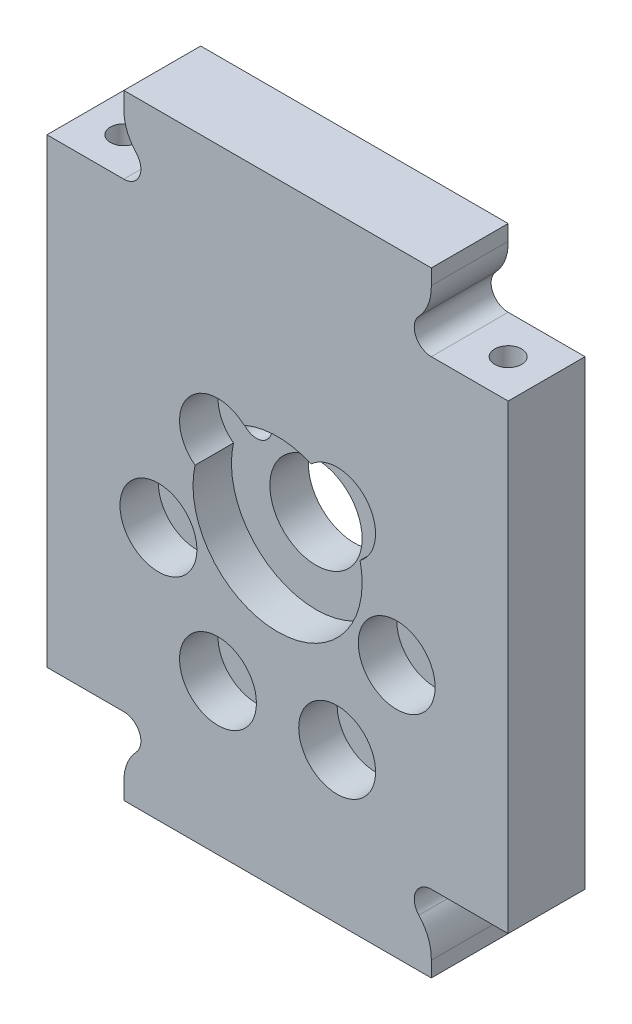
ISO-10303-21;
HEADER;
FILE_DESCRIPTION(('STEP AP214'),'2;1');
FILE_NAME('part.step','',(''),(''),'','','');
FILE_SCHEMA(('AUTOMOTIVE_DESIGN { 1 0 10303 214 1 1 1 1 }'));
ENDSEC;
DATA;
#1=APPLICATION_CONTEXT('core data for automotive mechanical design processes');
#2=APPLICATION_PROTOCOL_DEFINITION('international standard','automotive_design',2000,#1);
#3=PRODUCT_CONTEXT('',#1,'mechanical');
#4=PRODUCT('Part','Part','',(#3));
#5=PRODUCT_RELATED_PRODUCT_CATEGORY('part','',(#4));
#6=PRODUCT_DEFINITION_FORMATION('','',#4);
#7=PRODUCT_DEFINITION_CONTEXT('part definition',#1,'design');
#8=PRODUCT_DEFINITION('design','',#6,#7);
#9=PRODUCT_DEFINITION_SHAPE('','',#8);
#10=(LENGTH_UNIT() NAMED_UNIT(*) SI_UNIT(.MILLI.,.METRE.));
#11=(NAMED_UNIT(*) PLANE_ANGLE_UNIT() SI_UNIT($,.RADIAN.));
#12=(NAMED_UNIT(*) SI_UNIT($,.STERADIAN.) SOLID_ANGLE_UNIT());
#13=UNCERTAINTY_MEASURE_WITH_UNIT(LENGTH_MEASURE(1.E-05),#10,'distance_accuracy_value','');
#14=(GEOMETRIC_REPRESENTATION_CONTEXT(3) GLOBAL_UNCERTAINTY_ASSIGNED_CONTEXT((#13)) GLOBAL_UNIT_ASSIGNED_CONTEXT((#10,
#11,#12)) REPRESENTATION_CONTEXT('',''));
#15=CARTESIAN_POINT('',(0.,0.,0.));
#16=DIRECTION('',(0.,0.,1.));
#17=DIRECTION('',(1.,0.,0.));
#18=AXIS2_PLACEMENT_3D('',#15,#16,#17);
#19=CARTESIAN_POINT('',(0.,0.,0.));
#20=DIRECTION('',(0.,0.,1.));
#21=DIRECTION('',(1.,0.,0.));
#22=AXIS2_PLACEMENT_3D('',#19,#20,#21);
#23=CYLINDRICAL_SURFACE('',#22,6.);
#24=CARTESIAN_POINT('',(0.,0.,0.));
#25=DIRECTION('',(0.,0.,1.));
#26=DIRECTION('',(1.,0.,0.));
#27=AXIS2_PLACEMENT_3D('',#24,#25,#26);
#28=CIRCLE('',#27,6.);
#29=CARTESIAN_POINT('',(6.,0.,0.));
#30=VERTEX_POINT('',#29);
#31=EDGE_CURVE('E381',#30,#30,#28,.T.);
#32=ORIENTED_EDGE('',*,*,#31,.F.);
#33=EDGE_LOOP('',(#32));
#34=FACE_BOUND('',#33,.T.);
#35=CARTESIAN_POINT('',(0.,0.,5.));
#36=DIRECTION('',(0.,0.,1.));
#37=DIRECTION('',(1.,0.,0.));
#38=AXIS2_PLACEMENT_3D('',#35,#36,#37);
#39=CIRCLE('',#38,6.);
#40=CARTESIAN_POINT('',(6.,0.,5.));
#41=VERTEX_POINT('',#40);
#42=EDGE_CURVE('E244',#41,#41,#39,.F.);
#43=ORIENTED_EDGE('',*,*,#42,.F.);
#44=EDGE_LOOP('',(#43));
#45=FACE_BOUND('',#44,.T.);
#46=ADVANCED_FACE('F39',(#34,#45),#23,.F.);
#47=CARTESIAN_POINT('',(-15.5,-7.00000000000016,0.));
#48=DIRECTION('',(0.,0.,1.));
#49=DIRECTION('',(1.,0.,0.));
#50=AXIS2_PLACEMENT_3D('',#47,#48,#49);
#51=CYLINDRICAL_SURFACE('',#50,2.);
#52=CARTESIAN_POINT('',(-15.5,-7.00000000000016,0.));
#53=DIRECTION('',(0.,0.,1.));
#54=DIRECTION('',(0.50000000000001,-0.866025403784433,0.));
#55=AXIS2_PLACEMENT_3D('',#52,#53,#54);
#56=CIRCLE('',#55,2.);
#57=CARTESIAN_POINT('',(-14.5,-8.73205080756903,0.));
#58=VERTEX_POINT('',#57);
#59=EDGE_CURVE('E262',#58,#58,#56,.T.);
#60=ORIENTED_EDGE('',*,*,#59,.F.);
#61=EDGE_LOOP('',(#60));
#62=FACE_BOUND('',#61,.T.);
#63=CARTESIAN_POINT('',(-15.5,-7.00000000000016,5.));
#64=DIRECTION('',(0.,0.,1.));
#65=DIRECTION('',(1.,0.,0.));
#66=AXIS2_PLACEMENT_3D('',#63,#64,#65);
#67=CIRCLE('',#66,2.);
#68=CARTESIAN_POINT('',(-13.5,-7.00000000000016,5.));
#69=VERTEX_POINT('',#68);
#70=EDGE_CURVE('E43',#69,#69,#67,.F.);
#71=ORIENTED_EDGE('',*,*,#70,.F.);
#72=EDGE_LOOP('',(#71));
#73=FACE_BOUND('',#72,.T.);
#74=ADVANCED_FACE('F449',(#62,#73),#51,.F.);
#75=CARTESIAN_POINT('',(-7.75000000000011,6.42339375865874,0.));
#76=DIRECTION('',(0.,0.,1.));
#77=DIRECTION('',(1.,0.,0.));
#78=AXIS2_PLACEMENT_3D('',#75,#76,#77);
#79=CYLINDRICAL_SURFACE('',#78,2.);
#80=CARTESIAN_POINT('',(-7.75000000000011,6.42339375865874,0.));
#81=DIRECTION('',(0.,0.,1.));
#82=DIRECTION('',(-0.499999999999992,-0.866025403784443,0.));
#83=AXIS2_PLACEMENT_3D('',#80,#81,#82);
#84=CIRCLE('',#83,2.);
#85=CARTESIAN_POINT('',(-8.7500000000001,4.69134295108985,0.));
#86=VERTEX_POINT('',#85);
#87=EDGE_CURVE('E259',#86,#86,#84,.T.);
#88=ORIENTED_EDGE('',*,*,#87,.F.);
#89=EDGE_LOOP('',(#88));
#90=FACE_BOUND('',#89,.T.);
#91=CARTESIAN_POINT('',(-7.75000000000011,6.42339375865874,5.));
#92=DIRECTION('',(0.,0.,1.));
#93=DIRECTION('',(1.,0.,0.));
#94=AXIS2_PLACEMENT_3D('',#91,#92,#93);
#95=CIRCLE('',#94,2.);
#96=CARTESIAN_POINT('',(-5.75000000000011,6.42339375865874,5.));
#97=VERTEX_POINT('',#96);
#98=EDGE_CURVE('E247',#97,#97,#95,.F.);
#99=ORIENTED_EDGE('',*,*,#98,.F.);
#100=EDGE_LOOP('',(#99));
#101=FACE_BOUND('',#100,.T.);
#102=ADVANCED_FACE('F451',(#90,#101),#79,.F.);
#103=CARTESIAN_POINT('',(7.75000000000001,6.42339375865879,0.));
#104=DIRECTION('',(0.,0.,1.));
#105=DIRECTION('',(1.,0.,0.));
#106=AXIS2_PLACEMENT_3D('',#103,#104,#105);
#107=CYLINDRICAL_SURFACE('',#106,2.);
#108=CARTESIAN_POINT('',(7.75000000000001,6.42339375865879,0.));
#109=DIRECTION('',(0.,0.,1.));
#110=DIRECTION('',(-1.,0.,0.));
#111=AXIS2_PLACEMENT_3D('',#108,#109,#110);
#112=CIRCLE('',#111,2.);
#113=CARTESIAN_POINT('',(5.75000000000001,6.42339375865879,0.));
#114=VERTEX_POINT('',#113);
#115=EDGE_CURVE('E256',#114,#114,#112,.T.);
#116=ORIENTED_EDGE('',*,*,#115,.F.);
#117=EDGE_LOOP('',(#116));
#118=FACE_BOUND('',#117,.T.);
#119=CARTESIAN_POINT('',(7.75000000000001,6.42339375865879,5.));
#120=DIRECTION('',(0.,0.,1.));
#121=DIRECTION('',(1.,0.,0.));
#122=AXIS2_PLACEMENT_3D('',#119,#120,#121);
#123=CIRCLE('',#122,2.);
#124=CARTESIAN_POINT('',(9.75000000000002,6.42339375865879,5.));
#125=VERTEX_POINT('',#124);
#126=EDGE_CURVE('E248',#125,#125,#123,.F.);
#127=ORIENTED_EDGE('',*,*,#126,.F.);
#128=EDGE_LOOP('',(#127));
#129=FACE_BOUND('',#128,.T.);
#130=ADVANCED_FACE('F459',(#118,#129),#107,.F.);
#131=CARTESIAN_POINT('',(15.5,-6.99999999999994,0.));
#132=DIRECTION('',(0.,0.,1.));
#133=DIRECTION('',(1.,0.,0.));
#134=AXIS2_PLACEMENT_3D('',#131,#132,#133);
#135=CYLINDRICAL_SURFACE('',#134,2.);
#136=CARTESIAN_POINT('',(15.5,-6.99999999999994,0.));
#137=DIRECTION('',(0.,0.,1.));
#138=DIRECTION('',(-0.500000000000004,0.866025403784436,0.));
#139=AXIS2_PLACEMENT_3D('',#136,#137,#138);
#140=CIRCLE('',#139,2.);
#141=CARTESIAN_POINT('',(14.5,-5.26794919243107,0.));
#142=VERTEX_POINT('',#141);
#143=EDGE_CURVE('E253',#142,#142,#140,.T.);
#144=ORIENTED_EDGE('',*,*,#143,.F.);
#145=EDGE_LOOP('',(#144));
#146=FACE_BOUND('',#145,.T.);
#147=CARTESIAN_POINT('',(15.5,-6.99999999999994,5.));
#148=DIRECTION('',(0.,0.,1.));
#149=DIRECTION('',(1.,0.,0.));
#150=AXIS2_PLACEMENT_3D('',#147,#148,#149);
#151=CIRCLE('',#150,2.);
#152=CARTESIAN_POINT('',(17.5,-6.99999999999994,5.));
#153=VERTEX_POINT('',#152);
#154=EDGE_CURVE('E436',#153,#153,#151,.F.);
#155=ORIENTED_EDGE('',*,*,#154,.F.);
#156=EDGE_LOOP('',(#155));
#157=FACE_BOUND('',#156,.T.);
#158=ADVANCED_FACE('F832',(#146,#157),#135,.F.);
#159=CARTESIAN_POINT('',(7.75000000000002,-20.4233937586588,0.));
#160=DIRECTION('',(0.,0.,1.));
#161=DIRECTION('',(1.,0.,0.));
#162=AXIS2_PLACEMENT_3D('',#159,#160,#161);
#163=CYLINDRICAL_SURFACE('',#162,2.);
#164=CARTESIAN_POINT('',(7.75000000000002,-20.4233937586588,0.));
#165=DIRECTION('',(0.,0.,1.));
#166=DIRECTION('',(0.499999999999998,0.86602540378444,0.));
#167=AXIS2_PLACEMENT_3D('',#164,#165,#166);
#168=CIRCLE('',#167,2.);
#169=CARTESIAN_POINT('',(8.75000000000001,-18.6913429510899,0.));
#170=VERTEX_POINT('',#169);
#171=EDGE_CURVE('E249',#170,#170,#168,.T.);
#172=ORIENTED_EDGE('',*,*,#171,.F.);
#173=EDGE_LOOP('',(#172));
#174=FACE_BOUND('',#173,.T.);
#175=CARTESIAN_POINT('',(7.75000000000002,-20.4233937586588,5.));
#176=DIRECTION('',(0.,0.,1.));
#177=DIRECTION('',(1.,0.,0.));
#178=AXIS2_PLACEMENT_3D('',#175,#176,#177);
#179=CIRCLE('',#178,2.);
#180=CARTESIAN_POINT('',(9.75000000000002,-20.4233937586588,5.));
#181=VERTEX_POINT('',#180);
#182=EDGE_CURVE('E433',#181,#181,#179,.F.);
#183=ORIENTED_EDGE('',*,*,#182,.F.);
#184=EDGE_LOOP('',(#183));
#185=FACE_BOUND('',#184,.T.);
#186=ADVANCED_FACE('F481',(#174,#185),#163,.F.);
#187=CARTESIAN_POINT('',(-7.75000000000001,-20.4233937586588,0.));
#188=DIRECTION('',(0.,0.,1.));
#189=DIRECTION('',(1.,0.,0.));
#190=AXIS2_PLACEMENT_3D('',#187,#188,#189);
#191=CYLINDRICAL_SURFACE('',#190,2.);
#192=CARTESIAN_POINT('',(-7.75000000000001,-20.4233937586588,0.));
#193=DIRECTION('',(0.,0.,1.));
#194=DIRECTION('',(1.,0.,0.));
#195=AXIS2_PLACEMENT_3D('',#192,#193,#194);
#196=CIRCLE('',#195,2.);
#197=CARTESIAN_POINT('',(-5.75000000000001,-20.4233937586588,0.));
#198=VERTEX_POINT('',#197);
#199=EDGE_CURVE('E271',#198,#198,#196,.T.);
#200=ORIENTED_EDGE('',*,*,#199,.F.);
#201=EDGE_LOOP('',(#200));
#202=FACE_BOUND('',#201,.T.);
#203=CARTESIAN_POINT('',(-7.75000000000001,-20.4233937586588,5.));
#204=DIRECTION('',(0.,0.,1.));
#205=DIRECTION('',(1.,0.,0.));
#206=AXIS2_PLACEMENT_3D('',#203,#204,#205);
#207=CIRCLE('',#206,2.);
#208=CARTESIAN_POINT('',(-5.75000000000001,-20.4233937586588,5.));
#209=VERTEX_POINT('',#208);
#210=EDGE_CURVE('E268',#209,#209,#207,.F.);
#211=ORIENTED_EDGE('',*,*,#210,.F.);
#212=EDGE_LOOP('',(#211));
#213=FACE_BOUND('',#212,.T.);
#214=ADVANCED_FACE('F477',(#202,#213),#191,.F.);
#215=CARTESIAN_POINT('',(-29.9978281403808,-30.,10.));
#216=DIRECTION('',(0.,1.,0.));
#217=DIRECTION('',(-1.,0.,0.));
#218=AXIS2_PLACEMENT_3D('',#215,#216,#217);
#219=PLANE('',#218);
#220=CARTESIAN_POINT('',(25.,-30.,5.));
#221=DIRECTION('',(0.,1.,0.));
#222=DIRECTION('',(-1.,0.,0.));
#223=AXIS2_PLACEMENT_3D('',#220,#221,#222);
#224=CIRCLE('',#223,1.74999999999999);
#225=CARTESIAN_POINT('',(23.25,-30.,5.));
#226=VERTEX_POINT('',#225);
#227=EDGE_CURVE('E277',#226,#226,#224,.T.);
#228=ORIENTED_EDGE('',*,*,#227,.T.);
#229=EDGE_LOOP('',(#228));
#230=FACE_BOUND('',#229,.T.);
#231=DIRECTION('',(0.,0.,1.));
#232=VECTOR('',#231,1.);
#233=CARTESIAN_POINT('',(20.,-30.,0.));
#234=LINE('',#233,#232);
#235=CARTESIAN_POINT('',(20.,-30.,0.));
#236=VERTEX_POINT('',#235);
#237=CARTESIAN_POINT('',(20.,-30.,10.));
#238=VERTEX_POINT('',#237);
#239=EDGE_CURVE('E318',#236,#238,#234,.T.);
#240=ORIENTED_EDGE('',*,*,#239,.F.);
#241=DIRECTION('',(1.,0.,0.));
#242=VECTOR('',#241,1.);
#243=CARTESIAN_POINT('',(-29.9978281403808,-30.,0.));
#244=LINE('',#243,#242);
#245=CARTESIAN_POINT('',(29.9978281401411,-30.,0.));
#246=VERTEX_POINT('',#245);
#247=EDGE_CURVE('E420',#236,#246,#244,.T.);
#248=ORIENTED_EDGE('',*,*,#247,.T.);
#249=DIRECTION('',(0.,0.,-1.));
#250=VECTOR('',#249,1.);
#251=CARTESIAN_POINT('',(29.9978281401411,-30.,10.));
#252=LINE('',#251,#250);
#253=CARTESIAN_POINT('',(29.9978281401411,-30.,10.));
#254=VERTEX_POINT('',#253);
#255=EDGE_CURVE('E412',#254,#246,#252,.T.);
#256=ORIENTED_EDGE('',*,*,#255,.F.);
#257=DIRECTION('',(1.,0.,0.));
#258=VECTOR('',#257,1.);
#259=CARTESIAN_POINT('',(-29.9978281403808,-30.,10.));
#260=LINE('',#259,#258);
#261=EDGE_CURVE('E64',#238,#254,#260,.T.);
#262=ORIENTED_EDGE('',*,*,#261,.F.);
#263=EDGE_LOOP('',(#240,#248,#256,#262));
#264=FACE_BOUND('',#263,.T.);
#265=ADVANCED_FACE('F480',(#230,#264),#219,.F.);
#266=CARTESIAN_POINT('',(30.,30.,10.));
#267=DIRECTION('',(0.,-1.,0.));
#268=DIRECTION('',(1.,0.,0.));
#269=AXIS2_PLACEMENT_3D('',#266,#267,#268);
#270=PLANE('',#269);
#271=CARTESIAN_POINT('',(25.,30.,5.));
#272=DIRECTION('',(0.,1.,0.));
#273=DIRECTION('',(0.,0.,1.));
#274=AXIS2_PLACEMENT_3D('',#271,#272,#273);
#275=CIRCLE('',#274,1.74999999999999);
#276=CARTESIAN_POINT('',(25.,30.,6.74999999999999));
#277=VERTEX_POINT('',#276);
#278=EDGE_CURVE('E274',#277,#277,#275,.T.);
#279=ORIENTED_EDGE('',*,*,#278,.F.);
#280=EDGE_LOOP('',(#279));
#281=FACE_BOUND('',#280,.T.);
#282=DIRECTION('',(0.,0.,1.));
#283=VECTOR('',#282,1.);
#284=CARTESIAN_POINT('',(20.,30.,0.));
#285=LINE('',#284,#283);
#286=CARTESIAN_POINT('',(20.,30.,0.));
#287=VERTEX_POINT('',#286);
#288=CARTESIAN_POINT('',(20.,30.,10.));
#289=VERTEX_POINT('',#288);
#290=EDGE_CURVE('E392',#287,#289,#285,.T.);
#291=ORIENTED_EDGE('',*,*,#290,.T.);
#292=DIRECTION('',(-1.,0.,0.));
#293=VECTOR('',#292,1.);
#294=CARTESIAN_POINT('',(30.,30.,10.));
#295=LINE('',#294,#293);
#296=CARTESIAN_POINT('',(30.,30.,10.));
#297=VERTEX_POINT('',#296);
#298=EDGE_CURVE('E404',#297,#289,#295,.T.);
#299=ORIENTED_EDGE('',*,*,#298,.F.);
#300=DIRECTION('',(0.,0.,-1.));
#301=VECTOR('',#300,1.);
#302=CARTESIAN_POINT('',(30.,30.,10.));
#303=LINE('',#302,#301);
#304=CARTESIAN_POINT('',(30.,30.,0.));
#305=VERTEX_POINT('',#304);
#306=EDGE_CURVE('E11',#297,#305,#303,.T.);
#307=ORIENTED_EDGE('',*,*,#306,.T.);
#308=DIRECTION('',(-1.,0.,0.));
#309=VECTOR('',#308,1.);
#310=CARTESIAN_POINT('',(30.,30.,0.));
#311=LINE('',#310,#309);
#312=EDGE_CURVE('E416',#305,#287,#311,.T.);
#313=ORIENTED_EDGE('',*,*,#312,.T.);
#314=EDGE_LOOP('',(#291,#299,#307,#313));
#315=FACE_BOUND('',#314,.T.);
#316=ADVANCED_FACE('F564',(#281,#315),#270,.F.);
#317=CARTESIAN_POINT('',(30.,30.,10.));
#318=DIRECTION('',(-0.999999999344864,3.61976642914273E-05,0.));
#319=DIRECTION('',(-3.61976642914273E-05,-0.999999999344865,0.));
#320=AXIS2_PLACEMENT_3D('',#317,#318,#319);
#321=PLANE('',#320);
#322=DIRECTION('',(3.61976642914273E-05,0.999999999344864,0.));
#323=VECTOR('',#322,1.);
#324=CARTESIAN_POINT('',(30.,30.,0.));
#325=LINE('',#324,#323);
#326=EDGE_CURVE('E398',#246,#305,#325,.T.);
#327=ORIENTED_EDGE('',*,*,#326,.T.);
#328=ORIENTED_EDGE('',*,*,#306,.F.);
#329=DIRECTION('',(3.61976642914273E-05,0.999999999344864,0.));
#330=VECTOR('',#329,1.);
#331=CARTESIAN_POINT('',(30.,30.,10.));
#332=LINE('',#331,#330);
#333=EDGE_CURVE('E399',#254,#297,#332,.T.);
#334=ORIENTED_EDGE('',*,*,#333,.F.);
#335=ORIENTED_EDGE('',*,*,#255,.T.);
#336=EDGE_LOOP('',(#327,#328,#334,#335));
#337=FACE_BOUND('',#336,.T.);
#338=ADVANCED_FACE('F41',(#337),#321,.F.);
#339=CARTESIAN_POINT('',(-25.,30.,5.));
#340=DIRECTION('',(0.,1.,0.));
#341=DIRECTION('',(0.,0.,1.));
#342=AXIS2_PLACEMENT_3D('',#339,#340,#341);
#343=CIRCLE('',#342,1.74999999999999);
#344=CARTESIAN_POINT('',(-25.,30.,6.74999999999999));
#345=VERTEX_POINT('',#344);
#346=EDGE_CURVE('E280',#345,#345,#343,.T.);
#347=ORIENTED_EDGE('',*,*,#346,.F.);
#348=EDGE_LOOP('',(#347));
#349=FACE_BOUND('',#348,.T.);
#350=CARTESIAN_POINT('',(-20.,30.,10.));
#351=VERTEX_POINT('',#350);
#352=CARTESIAN_POINT('',(-30.,30.,10.));
#353=VERTEX_POINT('',#352);
#354=EDGE_CURVE('E402',#351,#353,#295,.T.);
#355=ORIENTED_EDGE('',*,*,#354,.F.);
#356=DIRECTION('',(0.,0.,1.));
#357=VECTOR('',#356,1.);
#358=CARTESIAN_POINT('',(-20.,30.,0.));
#359=LINE('',#358,#357);
#360=CARTESIAN_POINT('',(-20.,30.,0.));
#361=VERTEX_POINT('',#360);
#362=EDGE_CURVE('E359',#361,#351,#359,.T.);
#363=ORIENTED_EDGE('',*,*,#362,.F.);
#364=CARTESIAN_POINT('',(-30.,30.,0.));
#365=VERTEX_POINT('',#364);
#366=EDGE_CURVE('E415',#361,#365,#311,.T.);
#367=ORIENTED_EDGE('',*,*,#366,.T.);
#368=DIRECTION('',(0.,0.,-1.));
#369=VECTOR('',#368,1.);
#370=CARTESIAN_POINT('',(-30.,30.,10.));
#371=LINE('',#370,#369);
#372=EDGE_CURVE('E48',#353,#365,#371,.T.);
#373=ORIENTED_EDGE('',*,*,#372,.F.);
#374=EDGE_LOOP('',(#355,#363,#367,#373));
#375=FACE_BOUND('',#374,.T.);
#376=ADVANCED_FACE('F560',(#349,#375),#270,.F.);
#377=CARTESIAN_POINT('',(-30.,30.,10.));
#378=DIRECTION('',(0.999999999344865,3.61976602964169E-05,0.));
#379=DIRECTION('',(-3.61976602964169E-05,0.999999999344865,0.));
#380=AXIS2_PLACEMENT_3D('',#377,#378,#379);
#381=PLANE('',#380);
#382=DIRECTION('',(3.61976602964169E-05,-0.999999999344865,0.));
#383=VECTOR('',#382,1.);
#384=CARTESIAN_POINT('',(-30.,30.,0.));
#385=LINE('',#384,#383);
#386=CARTESIAN_POINT('',(-29.9978281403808,-30.,0.));
#387=VERTEX_POINT('',#386);
#388=EDGE_CURVE('E418',#365,#387,#385,.T.);
#389=ORIENTED_EDGE('',*,*,#388,.T.);
#390=DIRECTION('',(0.,0.,-1.));
#391=VECTOR('',#390,1.);
#392=CARTESIAN_POINT('',(-29.9978281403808,-30.,10.));
#393=LINE('',#392,#391);
#394=CARTESIAN_POINT('',(-29.9978281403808,-30.,10.));
#395=VERTEX_POINT('',#394);
#396=EDGE_CURVE('E424',#395,#387,#393,.T.);
#397=ORIENTED_EDGE('',*,*,#396,.F.);
#398=DIRECTION('',(3.61976602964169E-05,-0.999999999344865,0.));
#399=VECTOR('',#398,1.);
#400=CARTESIAN_POINT('',(-30.,30.,10.));
#401=LINE('',#400,#399);
#402=EDGE_CURVE('E407',#353,#395,#401,.T.);
#403=ORIENTED_EDGE('',*,*,#402,.F.);
#404=ORIENTED_EDGE('',*,*,#372,.T.);
#405=EDGE_LOOP('',(#389,#397,#403,#404));
#406=FACE_BOUND('',#405,.T.);
#407=ADVANCED_FACE('F557',(#406),#381,.F.);
#408=CARTESIAN_POINT('',(-25.,-30.,5.));
#409=DIRECTION('',(0.,1.,0.));
#410=DIRECTION('',(-1.,0.,0.));
#411=AXIS2_PLACEMENT_3D('',#408,#409,#410);
#412=CIRCLE('',#411,1.74999999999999);
#413=CARTESIAN_POINT('',(-26.75,-30.,5.));
#414=VERTEX_POINT('',#413);
#415=EDGE_CURVE('E283',#414,#414,#412,.T.);
#416=ORIENTED_EDGE('',*,*,#415,.T.);
#417=EDGE_LOOP('',(#416));
#418=FACE_BOUND('',#417,.T.);
#419=CARTESIAN_POINT('',(-20.,-30.,0.));
#420=VERTEX_POINT('',#419);
#421=EDGE_CURVE('E403',#387,#420,#244,.T.);
#422=ORIENTED_EDGE('',*,*,#421,.T.);
#423=DIRECTION('',(0.,0.,1.));
#424=VECTOR('',#423,1.);
#425=CARTESIAN_POINT('',(-20.,-30.,0.));
#426=LINE('',#425,#424);
#427=CARTESIAN_POINT('',(-20.,-30.,10.));
#428=VERTEX_POINT('',#427);
#429=EDGE_CURVE('E315',#420,#428,#426,.T.);
#430=ORIENTED_EDGE('',*,*,#429,.T.);
#431=EDGE_CURVE('E409',#395,#428,#260,.T.);
#432=ORIENTED_EDGE('',*,*,#431,.F.);
#433=ORIENTED_EDGE('',*,*,#396,.T.);
#434=EDGE_LOOP('',(#422,#430,#432,#433));
#435=FACE_BOUND('',#434,.T.);
#436=ADVANCED_FACE('F550',(#418,#435),#219,.F.);
#437=CARTESIAN_POINT('',(0.,0.,10.));
#438=DIRECTION('',(0.,0.,1.));
#439=DIRECTION('',(1.,0.,0.));
#440=AXIS2_PLACEMENT_3D('',#437,#438,#439);
#441=PLANE('',#440);
#442=CARTESIAN_POINT('',(0.,0.,10.));
#443=DIRECTION('',(0.,0.,1.));
#444=DIRECTION('',(1.,0.,0.));
#445=AXIS2_PLACEMENT_3D('',#442,#443,#444);
#446=CIRCLE('',#445,11.);
#447=CARTESIAN_POINT('',(4.36024104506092,10.0989255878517,10.));
#448=VERTEX_POINT('',#447);
#449=CARTESIAN_POINT('',(-4.36024104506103,10.0989255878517,10.));
#450=VERTEX_POINT('',#449);
#451=EDGE_CURVE('E222',#448,#450,#446,.T.);
#452=ORIENTED_EDGE('',*,*,#451,.F.);
#453=CARTESIAN_POINT('',(7.75000000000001,6.42339375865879,10.));
#454=DIRECTION('',(0.,0.,1.));
#455=DIRECTION('',(-1.,0.,0.));
#456=AXIS2_PLACEMENT_3D('',#453,#454,#455);
#457=CIRCLE('',#456,5.);
#458=CARTESIAN_POINT('',(10.7326501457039,2.41043997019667,10.));
#459=VERTEX_POINT('',#458);
#460=EDGE_CURVE('E227',#459,#448,#457,.T.);
#461=ORIENTED_EDGE('',*,*,#460,.F.);
#462=CARTESIAN_POINT('',(-10.7326501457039,2.41043997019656,10.));
#463=VERTEX_POINT('',#462);
#464=EDGE_CURVE('E209',#463,#459,#446,.T.);
#465=ORIENTED_EDGE('',*,*,#464,.F.);
#466=CARTESIAN_POINT('',(-7.75000000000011,6.42339375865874,10.));
#467=DIRECTION('',(0.,0.,1.));
#468=DIRECTION('',(-0.499999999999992,-0.866025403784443,0.));
#469=AXIS2_PLACEMENT_3D('',#466,#467,#468);
#470=CIRCLE('',#469,5.);
#471=EDGE_CURVE('E236',#450,#463,#470,.T.);
#472=ORIENTED_EDGE('',*,*,#471,.F.);
#473=EDGE_LOOP('',(#452,#461,#465,#472));
#474=FACE_BOUND('',#473,.T.);
#475=CARTESIAN_POINT('',(7.75000000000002,-20.4233937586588,10.));
#476=DIRECTION('',(0.,0.,1.));
#477=DIRECTION('',(0.499999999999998,0.86602540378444,0.));
#478=AXIS2_PLACEMENT_3D('',#475,#476,#477);
#479=CIRCLE('',#478,5.);
#480=CARTESIAN_POINT('',(10.25,-16.0932667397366,10.));
#481=VERTEX_POINT('',#480);
#482=EDGE_CURVE('E987',#481,#481,#479,.T.);
#483=ORIENTED_EDGE('',*,*,#482,.F.);
#484=EDGE_LOOP('',(#483));
#485=FACE_BOUND('',#484,.T.);
#486=CARTESIAN_POINT('',(15.5,-6.99999999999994,10.));
#487=DIRECTION('',(0.,0.,1.));
#488=DIRECTION('',(-0.500000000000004,0.866025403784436,0.));
#489=AXIS2_PLACEMENT_3D('',#486,#487,#488);
#490=CIRCLE('',#489,5.);
#491=CARTESIAN_POINT('',(13.,-2.66987298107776,10.));
#492=VERTEX_POINT('',#491);
#493=EDGE_CURVE('E226',#492,#492,#490,.T.);
#494=ORIENTED_EDGE('',*,*,#493,.F.);
#495=EDGE_LOOP('',(#494));
#496=FACE_BOUND('',#495,.T.);
#497=CARTESIAN_POINT('',(-15.5,-7.00000000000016,10.));
#498=DIRECTION('',(0.,0.,1.));
#499=DIRECTION('',(0.50000000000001,-0.866025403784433,0.));
#500=AXIS2_PLACEMENT_3D('',#497,#498,#499);
#501=CIRCLE('',#500,5.);
#502=CARTESIAN_POINT('',(-12.9999999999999,-11.3301270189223,10.));
#503=VERTEX_POINT('',#502);
#504=EDGE_CURVE('E214',#503,#503,#501,.T.);
#505=ORIENTED_EDGE('',*,*,#504,.F.);
#506=EDGE_LOOP('',(#505));
#507=FACE_BOUND('',#506,.T.);
#508=CARTESIAN_POINT('',(-7.75000000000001,-20.4233937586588,10.));
#509=DIRECTION('',(0.,0.,1.));
#510=DIRECTION('',(1.,0.,0.));
#511=AXIS2_PLACEMENT_3D('',#508,#509,#510);
#512=CIRCLE('',#511,5.);
#513=CARTESIAN_POINT('',(-2.75000000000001,-20.4233937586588,10.));
#514=VERTEX_POINT('',#513);
#515=EDGE_CURVE('E252',#514,#514,#512,.T.);
#516=ORIENTED_EDGE('',*,*,#515,.F.);
#517=EDGE_LOOP('',(#516));
#518=FACE_BOUND('',#517,.T.);
#519=ORIENTED_EDGE('',*,*,#333,.T.);
#520=ORIENTED_EDGE('',*,*,#298,.T.);
#521=CARTESIAN_POINT('',(20.,32.2199999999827,10.));
#522=DIRECTION('',(0.,0.,-1.));
#523=DIRECTION('',(-1.,0.,0.));
#524=AXIS2_PLACEMENT_3D('',#521,#522,#523);
#525=CIRCLE('',#524,2.21999999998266);
#526=CARTESIAN_POINT('',(18.3801323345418,33.7380345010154,10.));
#527=VERTEX_POINT('',#526);
#528=EDGE_CURVE('E362',#289,#527,#525,.T.);
#529=ORIENTED_EDGE('',*,*,#528,.T.);
#530=CARTESIAN_POINT('',(14.0021116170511,37.8408304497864,10.));
#531=DIRECTION('',(0.,0.,1.));
#532=DIRECTION('',(-1.,0.,0.));
#533=AXIS2_PLACEMENT_3D('',#530,#531,#532);
#534=CIRCLE('',#533,6.00000000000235);
#535=CARTESIAN_POINT('',(20.,38.0000000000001,10.));
#536=VERTEX_POINT('',#535);
#537=EDGE_CURVE('E365',#527,#536,#534,.T.);
#538=ORIENTED_EDGE('',*,*,#537,.T.);
#539=DIRECTION('',(0.,1.,0.));
#540=VECTOR('',#539,1.);
#541=CARTESIAN_POINT('',(20.,38.0000000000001,10.));
#542=LINE('',#541,#540);
#543=CARTESIAN_POINT('',(20.,40.,10.));
#544=VERTEX_POINT('',#543);
#545=EDGE_CURVE('E368',#536,#544,#542,.T.);
#546=ORIENTED_EDGE('',*,*,#545,.T.);
#547=DIRECTION('',(-1.,0.,0.));
#548=VECTOR('',#547,1.);
#549=CARTESIAN_POINT('',(-20.,40.,10.));
#550=LINE('',#549,#548);
#551=CARTESIAN_POINT('',(-20.,40.,10.));
#552=VERTEX_POINT('',#551);
#553=EDGE_CURVE('E371',#544,#552,#550,.T.);
#554=ORIENTED_EDGE('',*,*,#553,.T.);
#555=DIRECTION('',(0.,-1.,0.));
#556=VECTOR('',#555,1.);
#557=CARTESIAN_POINT('',(-20.,38.0000000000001,10.));
#558=LINE('',#557,#556);
#559=CARTESIAN_POINT('',(-20.,38.0000000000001,10.));
#560=VERTEX_POINT('',#559);
#561=EDGE_CURVE('E374',#552,#560,#558,.T.);
#562=ORIENTED_EDGE('',*,*,#561,.T.);
#563=CARTESIAN_POINT('',(-14.0021116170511,37.8408304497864,10.));
#564=DIRECTION('',(0.,0.,1.));
#565=DIRECTION('',(1.,0.,0.));
#566=AXIS2_PLACEMENT_3D('',#563,#564,#565);
#567=CIRCLE('',#566,6.00000000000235);
#568=CARTESIAN_POINT('',(-18.3801323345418,33.7380345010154,10.));
#569=VERTEX_POINT('',#568);
#570=EDGE_CURVE('E341',#560,#569,#567,.T.);
#571=ORIENTED_EDGE('',*,*,#570,.T.);
#572=CARTESIAN_POINT('',(-20.,32.2199999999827,10.));
#573=DIRECTION('',(0.,0.,-1.));
#574=DIRECTION('',(1.,0.,0.));
#575=AXIS2_PLACEMENT_3D('',#572,#573,#574);
#576=CIRCLE('',#575,2.21999999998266);
#577=EDGE_CURVE('E317',#569,#351,#576,.T.);
#578=ORIENTED_EDGE('',*,*,#577,.T.);
#579=ORIENTED_EDGE('',*,*,#354,.T.);
#580=ORIENTED_EDGE('',*,*,#402,.T.);
#581=ORIENTED_EDGE('',*,*,#431,.T.);
#582=CARTESIAN_POINT('',(-20.,-32.2199999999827,10.));
#583=DIRECTION('',(0.,0.,1.));
#584=DIRECTION('',(1.,0.,0.));
#585=AXIS2_PLACEMENT_3D('',#582,#583,#584);
#586=CIRCLE('',#585,2.21999999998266);
#587=CARTESIAN_POINT('',(-18.3801323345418,-33.7380345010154,10.));
#588=VERTEX_POINT('',#587);
#589=EDGE_CURVE('E301',#588,#428,#586,.T.);
#590=ORIENTED_EDGE('',*,*,#589,.F.);
#591=CARTESIAN_POINT('',(-14.0021116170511,-37.8408304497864,10.));
#592=DIRECTION('',(0.,0.,-1.));
#593=DIRECTION('',(1.,0.,0.));
#594=AXIS2_PLACEMENT_3D('',#591,#592,#593);
#595=CIRCLE('',#594,6.00000000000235);
#596=CARTESIAN_POINT('',(-20.,-38.0000000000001,10.));
#597=VERTEX_POINT('',#596);
#598=EDGE_CURVE('E304',#597,#588,#595,.T.);
#599=ORIENTED_EDGE('',*,*,#598,.F.);
#600=DIRECTION('',(0.,1.,0.));
#601=VECTOR('',#600,1.);
#602=CARTESIAN_POINT('',(-20.,-38.0000000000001,10.));
#603=LINE('',#602,#601);
#604=CARTESIAN_POINT('',(-20.,-40.,10.));
#605=VERTEX_POINT('',#604);
#606=EDGE_CURVE('E306',#605,#597,#603,.T.);
#607=ORIENTED_EDGE('',*,*,#606,.F.);
#608=DIRECTION('',(-1.,0.,0.));
#609=VECTOR('',#608,1.);
#610=CARTESIAN_POINT('',(-20.,-40.,10.));
#611=LINE('',#610,#609);
#612=CARTESIAN_POINT('',(20.,-40.,10.));
#613=VERTEX_POINT('',#612);
#614=EDGE_CURVE('E308',#613,#605,#611,.T.);
#615=ORIENTED_EDGE('',*,*,#614,.F.);
#616=DIRECTION('',(0.,-1.,0.));
#617=VECTOR('',#616,1.);
#618=CARTESIAN_POINT('',(20.,-38.0000000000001,10.));
#619=LINE('',#618,#617);
#620=CARTESIAN_POINT('',(20.,-38.0000000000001,10.));
#621=VERTEX_POINT('',#620);
#622=EDGE_CURVE('E310',#621,#613,#619,.T.);
#623=ORIENTED_EDGE('',*,*,#622,.F.);
#624=CARTESIAN_POINT('',(14.0021116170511,-37.8408304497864,10.));
#625=DIRECTION('',(0.,0.,-1.));
#626=DIRECTION('',(-1.,0.,0.));
#627=AXIS2_PLACEMENT_3D('',#624,#625,#626);
#628=CIRCLE('',#627,6.00000000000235);
#629=CARTESIAN_POINT('',(18.3801323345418,-33.7380345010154,10.));
#630=VERTEX_POINT('',#629);
#631=EDGE_CURVE('E312',#630,#621,#628,.T.);
#632=ORIENTED_EDGE('',*,*,#631,.F.);
#633=CARTESIAN_POINT('',(20.,-32.2199999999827,10.));
#634=DIRECTION('',(0.,0.,1.));
#635=DIRECTION('',(-1.,0.,0.));
#636=AXIS2_PLACEMENT_3D('',#633,#634,#635);
#637=CIRCLE('',#636,2.21999999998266);
#638=EDGE_CURVE('E288',#238,#630,#637,.T.);
#639=ORIENTED_EDGE('',*,*,#638,.F.);
#640=ORIENTED_EDGE('',*,*,#261,.T.);
#641=EDGE_LOOP('',(#519,#520,#529,#538,#546,#554,#562,#571,#578,#579,#580,#581,#590,#599,#607,
#615,#623,#632,#639,#640));
#642=FACE_BOUND('',#641,.T.);
#643=ADVANCED_FACE('F547',(#474,#485,#496,#507,#518,#642),#441,.T.);
#644=CARTESIAN_POINT('',(0.,0.,0.));
#645=DIRECTION('',(0.,0.,1.));
#646=DIRECTION('',(1.,0.,0.));
#647=AXIS2_PLACEMENT_3D('',#644,#645,#646);
#648=PLANE('',#647);
#649=ORIENTED_EDGE('',*,*,#171,.T.);
#650=EDGE_LOOP('',(#649));
#651=FACE_BOUND('',#650,.T.);
#652=ORIENTED_EDGE('',*,*,#143,.T.);
#653=EDGE_LOOP('',(#652));
#654=FACE_BOUND('',#653,.T.);
#655=ORIENTED_EDGE('',*,*,#115,.T.);
#656=EDGE_LOOP('',(#655));
#657=FACE_BOUND('',#656,.T.);
#658=ORIENTED_EDGE('',*,*,#87,.T.);
#659=EDGE_LOOP('',(#658));
#660=FACE_BOUND('',#659,.T.);
#661=ORIENTED_EDGE('',*,*,#59,.T.);
#662=EDGE_LOOP('',(#661));
#663=FACE_BOUND('',#662,.T.);
#664=ORIENTED_EDGE('',*,*,#199,.T.);
#665=EDGE_LOOP('',(#664));
#666=FACE_BOUND('',#665,.T.);
#667=ORIENTED_EDGE('',*,*,#31,.T.);
#668=EDGE_LOOP('',(#667));
#669=FACE_BOUND('',#668,.T.);
#670=ORIENTED_EDGE('',*,*,#326,.F.);
#671=ORIENTED_EDGE('',*,*,#247,.F.);
#672=CARTESIAN_POINT('',(20.,-32.2199999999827,0.));
#673=DIRECTION('',(0.,0.,1.));
#674=DIRECTION('',(-1.,0.,0.));
#675=AXIS2_PLACEMENT_3D('',#672,#673,#674);
#676=CIRCLE('',#675,2.21999999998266);
#677=CARTESIAN_POINT('',(18.3801323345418,-33.7380345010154,0.));
#678=VERTEX_POINT('',#677);
#679=EDGE_CURVE('E298',#236,#678,#676,.T.);
#680=ORIENTED_EDGE('',*,*,#679,.T.);
#681=CARTESIAN_POINT('',(14.0021116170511,-37.8408304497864,0.));
#682=DIRECTION('',(0.,0.,-1.));
#683=DIRECTION('',(-1.,0.,0.));
#684=AXIS2_PLACEMENT_3D('',#681,#682,#683);
#685=CIRCLE('',#684,6.00000000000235);
#686=CARTESIAN_POINT('',(20.,-38.0000000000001,0.));
#687=VERTEX_POINT('',#686);
#688=EDGE_CURVE('E296',#678,#687,#685,.T.);
#689=ORIENTED_EDGE('',*,*,#688,.T.);
#690=DIRECTION('',(0.,-1.,0.));
#691=VECTOR('',#690,1.);
#692=CARTESIAN_POINT('',(20.,-38.0000000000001,0.));
#693=LINE('',#692,#691);
#694=CARTESIAN_POINT('',(20.,-40.,0.));
#695=VERTEX_POINT('',#694);
#696=EDGE_CURVE('E294',#687,#695,#693,.T.);
#697=ORIENTED_EDGE('',*,*,#696,.T.);
#698=DIRECTION('',(-1.,0.,0.));
#699=VECTOR('',#698,1.);
#700=CARTESIAN_POINT('',(-20.,-40.,0.));
#701=LINE('',#700,#699);
#702=CARTESIAN_POINT('',(-20.,-40.,0.));
#703=VERTEX_POINT('',#702);
#704=EDGE_CURVE('E292',#695,#703,#701,.T.);
#705=ORIENTED_EDGE('',*,*,#704,.T.);
#706=DIRECTION('',(0.,1.,0.));
#707=VECTOR('',#706,1.);
#708=CARTESIAN_POINT('',(-20.,-38.0000000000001,0.));
#709=LINE('',#708,#707);
#710=CARTESIAN_POINT('',(-20.,-38.0000000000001,0.));
#711=VERTEX_POINT('',#710);
#712=EDGE_CURVE('E290',#703,#711,#709,.T.);
#713=ORIENTED_EDGE('',*,*,#712,.T.);
#714=CARTESIAN_POINT('',(-14.0021116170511,-37.8408304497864,0.));
#715=DIRECTION('',(0.,0.,-1.));
#716=DIRECTION('',(1.,0.,0.));
#717=AXIS2_PLACEMENT_3D('',#714,#715,#716);
#718=CIRCLE('',#717,6.00000000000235);
#719=CARTESIAN_POINT('',(-18.3801323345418,-33.7380345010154,0.));
#720=VERTEX_POINT('',#719);
#721=EDGE_CURVE('E287',#711,#720,#718,.T.);
#722=ORIENTED_EDGE('',*,*,#721,.T.);
#723=CARTESIAN_POINT('',(-20.,-32.2199999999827,0.));
#724=DIRECTION('',(0.,0.,1.));
#725=DIRECTION('',(1.,0.,0.));
#726=AXIS2_PLACEMENT_3D('',#723,#724,#725);
#727=CIRCLE('',#726,2.21999999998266);
#728=EDGE_CURVE('E284',#720,#420,#727,.T.);
#729=ORIENTED_EDGE('',*,*,#728,.T.);
#730=ORIENTED_EDGE('',*,*,#421,.F.);
#731=ORIENTED_EDGE('',*,*,#388,.F.);
#732=ORIENTED_EDGE('',*,*,#366,.F.);
#733=CARTESIAN_POINT('',(-20.,32.2199999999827,0.));
#734=DIRECTION('',(0.,0.,-1.));
#735=DIRECTION('',(1.,0.,0.));
#736=AXIS2_PLACEMENT_3D('',#733,#734,#735);
#737=CIRCLE('',#736,2.21999999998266);
#738=CARTESIAN_POINT('',(-18.3801323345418,33.7380345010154,0.));
#739=VERTEX_POINT('',#738);
#740=EDGE_CURVE('E337',#739,#361,#737,.T.);
#741=ORIENTED_EDGE('',*,*,#740,.F.);
#742=CARTESIAN_POINT('',(-14.0021116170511,37.8408304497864,0.));
#743=DIRECTION('',(0.,0.,1.));
#744=DIRECTION('',(1.,0.,0.));
#745=AXIS2_PLACEMENT_3D('',#742,#743,#744);
#746=CIRCLE('',#745,6.00000000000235);
#747=CARTESIAN_POINT('',(-20.,38.0000000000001,0.));
#748=VERTEX_POINT('',#747);
#749=EDGE_CURVE('E356',#748,#739,#746,.T.);
#750=ORIENTED_EDGE('',*,*,#749,.F.);
#751=DIRECTION('',(0.,-1.,0.));
#752=VECTOR('',#751,1.);
#753=CARTESIAN_POINT('',(-20.,38.0000000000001,0.));
#754=LINE('',#753,#752);
#755=CARTESIAN_POINT('',(-20.,40.,0.));
#756=VERTEX_POINT('',#755);
#757=EDGE_CURVE('E353',#756,#748,#754,.T.);
#758=ORIENTED_EDGE('',*,*,#757,.F.);
#759=DIRECTION('',(-1.,0.,0.));
#760=VECTOR('',#759,1.);
#761=CARTESIAN_POINT('',(-20.,40.,0.));
#762=LINE('',#761,#760);
#763=CARTESIAN_POINT('',(20.,40.,0.));
#764=VERTEX_POINT('',#763);
#765=EDGE_CURVE('E350',#764,#756,#762,.T.);
#766=ORIENTED_EDGE('',*,*,#765,.F.);
#767=DIRECTION('',(0.,1.,0.));
#768=VECTOR('',#767,1.);
#769=CARTESIAN_POINT('',(20.,38.0000000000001,0.));
#770=LINE('',#769,#768);
#771=CARTESIAN_POINT('',(20.,38.0000000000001,0.));
#772=VERTEX_POINT('',#771);
#773=EDGE_CURVE('E347',#772,#764,#770,.T.);
#774=ORIENTED_EDGE('',*,*,#773,.F.);
#775=CARTESIAN_POINT('',(14.0021116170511,37.8408304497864,0.));
#776=DIRECTION('',(0.,0.,1.));
#777=DIRECTION('',(-1.,0.,0.));
#778=AXIS2_PLACEMENT_3D('',#775,#776,#777);
#779=CIRCLE('',#778,6.00000000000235);
#780=CARTESIAN_POINT('',(18.3801323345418,33.7380345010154,0.));
#781=VERTEX_POINT('',#780);
#782=EDGE_CURVE('E344',#781,#772,#779,.T.);
#783=ORIENTED_EDGE('',*,*,#782,.F.);
#784=CARTESIAN_POINT('',(20.,32.2199999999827,0.));
#785=DIRECTION('',(0.,0.,-1.));
#786=DIRECTION('',(-1.,0.,0.));
#787=AXIS2_PLACEMENT_3D('',#784,#785,#786);
#788=CIRCLE('',#787,2.21999999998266);
#789=EDGE_CURVE('E340',#287,#781,#788,.T.);
#790=ORIENTED_EDGE('',*,*,#789,.F.);
#791=ORIENTED_EDGE('',*,*,#312,.F.);
#792=EDGE_LOOP('',(#670,#671,#680,#689,#697,#705,#713,#722,#729,#730,#731,#732,#741,#750,#758,
#766,#774,#783,#790,#791));
#793=FACE_BOUND('',#792,.T.);
#794=ADVANCED_FACE('F544',(#651,#654,#657,#660,#663,#666,#669,#793),#648,.F.);
#795=CARTESIAN_POINT('',(-20.,32.2199999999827,0.));
#796=DIRECTION('',(0.,0.,1.));
#797=DIRECTION('',(1.,0.,0.));
#798=AXIS2_PLACEMENT_3D('',#795,#796,#797);
#799=CYLINDRICAL_SURFACE('',#798,2.21999999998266);
#800=ORIENTED_EDGE('',*,*,#577,.F.);
#801=DIRECTION('',(0.,0.,1.));
#802=VECTOR('',#801,1.);
#803=CARTESIAN_POINT('',(-18.3801323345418,33.7380345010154,0.));
#804=LINE('',#803,#802);
#805=EDGE_CURVE('E379',#739,#569,#804,.T.);
#806=ORIENTED_EDGE('',*,*,#805,.F.);
#807=ORIENTED_EDGE('',*,*,#740,.T.);
#808=ORIENTED_EDGE('',*,*,#362,.T.);
#809=EDGE_LOOP('',(#800,#806,#807,#808));
#810=FACE_BOUND('',#809,.T.);
#811=ADVANCED_FACE('F523',(#810),#799,.F.);
#812=CARTESIAN_POINT('',(-14.0021116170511,37.8408304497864,0.));
#813=DIRECTION('',(0.,0.,1.));
#814=DIRECTION('',(1.,0.,0.));
#815=AXIS2_PLACEMENT_3D('',#812,#813,#814);
#816=CYLINDRICAL_SURFACE('',#815,6.00000000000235);
#817=ORIENTED_EDGE('',*,*,#570,.F.);
#818=DIRECTION('',(0.,0.,1.));
#819=VECTOR('',#818,1.);
#820=CARTESIAN_POINT('',(-20.,38.0000000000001,0.));
#821=LINE('',#820,#819);
#822=EDGE_CURVE('E382',#748,#560,#821,.T.);
#823=ORIENTED_EDGE('',*,*,#822,.F.);
#824=ORIENTED_EDGE('',*,*,#749,.T.);
#825=ORIENTED_EDGE('',*,*,#805,.T.);
#826=EDGE_LOOP('',(#817,#823,#824,#825));
#827=FACE_BOUND('',#826,.T.);
#828=ADVANCED_FACE('F519',(#827),#816,.T.);
#829=CARTESIAN_POINT('',(-20.,38.0000000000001,0.));
#830=DIRECTION('',(-1.,0.,0.));
#831=DIRECTION('',(0.,-1.,0.));
#832=AXIS2_PLACEMENT_3D('',#829,#830,#831);
#833=PLANE('',#832);
#834=ORIENTED_EDGE('',*,*,#561,.F.);
#835=DIRECTION('',(0.,0.,1.));
#836=VECTOR('',#835,1.);
#837=CARTESIAN_POINT('',(-20.,40.,0.));
#838=LINE('',#837,#836);
#839=EDGE_CURVE('E384',#756,#552,#838,.T.);
#840=ORIENTED_EDGE('',*,*,#839,.F.);
#841=ORIENTED_EDGE('',*,*,#757,.T.);
#842=ORIENTED_EDGE('',*,*,#822,.T.);
#843=EDGE_LOOP('',(#834,#840,#841,#842));
#844=FACE_BOUND('',#843,.T.);
#845=ADVANCED_FACE('F522',(#844),#833,.T.);
#846=CARTESIAN_POINT('',(-20.,40.,0.));
#847=DIRECTION('',(0.,1.,0.));
#848=DIRECTION('',(0.,0.,1.));
#849=AXIS2_PLACEMENT_3D('',#846,#847,#848);
#850=PLANE('',#849);
#851=ORIENTED_EDGE('',*,*,#553,.F.);
#852=DIRECTION('',(0.,0.,1.));
#853=VECTOR('',#852,1.);
#854=CARTESIAN_POINT('',(20.,40.,0.));
#855=LINE('',#854,#853);
#856=EDGE_CURVE('E386',#764,#544,#855,.T.);
#857=ORIENTED_EDGE('',*,*,#856,.F.);
#858=ORIENTED_EDGE('',*,*,#765,.T.);
#859=ORIENTED_EDGE('',*,*,#839,.T.);
#860=EDGE_LOOP('',(#851,#857,#858,#859));
#861=FACE_BOUND('',#860,.T.);
#862=ADVANCED_FACE('F527',(#861),#850,.T.);
#863=CARTESIAN_POINT('',(20.,38.0000000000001,0.));
#864=DIRECTION('',(1.,0.,0.));
#865=DIRECTION('',(0.,1.,0.));
#866=AXIS2_PLACEMENT_3D('',#863,#864,#865);
#867=PLANE('',#866);
#868=ORIENTED_EDGE('',*,*,#545,.F.);
#869=DIRECTION('',(0.,0.,1.));
#870=VECTOR('',#869,1.);
#871=CARTESIAN_POINT('',(20.,38.0000000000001,0.));
#872=LINE('',#871,#870);
#873=EDGE_CURVE('E388',#772,#536,#872,.T.);
#874=ORIENTED_EDGE('',*,*,#873,.F.);
#875=ORIENTED_EDGE('',*,*,#773,.T.);
#876=ORIENTED_EDGE('',*,*,#856,.T.);
#877=EDGE_LOOP('',(#868,#874,#875,#876));
#878=FACE_BOUND('',#877,.T.);
#879=ADVANCED_FACE('F531',(#878),#867,.T.);
#880=CARTESIAN_POINT('',(14.0021116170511,37.8408304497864,0.));
#881=DIRECTION('',(0.,0.,1.));
#882=DIRECTION('',(1.,0.,0.));
#883=AXIS2_PLACEMENT_3D('',#880,#881,#882);
#884=CYLINDRICAL_SURFACE('',#883,6.00000000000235);
#885=ORIENTED_EDGE('',*,*,#537,.F.);
#886=DIRECTION('',(0.,0.,1.));
#887=VECTOR('',#886,1.);
#888=CARTESIAN_POINT('',(18.3801323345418,33.7380345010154,0.));
#889=LINE('',#888,#887);
#890=EDGE_CURVE('E390',#781,#527,#889,.T.);
#891=ORIENTED_EDGE('',*,*,#890,.F.);
#892=ORIENTED_EDGE('',*,*,#782,.T.);
#893=ORIENTED_EDGE('',*,*,#873,.T.);
#894=EDGE_LOOP('',(#885,#891,#892,#893));
#895=FACE_BOUND('',#894,.T.);
#896=ADVANCED_FACE('F535',(#895),#884,.T.);
#897=CARTESIAN_POINT('',(20.,32.2199999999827,0.));
#898=DIRECTION('',(0.,0.,1.));
#899=DIRECTION('',(1.,0.,0.));
#900=AXIS2_PLACEMENT_3D('',#897,#898,#899);
#901=CYLINDRICAL_SURFACE('',#900,2.21999999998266);
#902=ORIENTED_EDGE('',*,*,#528,.F.);
#903=ORIENTED_EDGE('',*,*,#290,.F.);
#904=ORIENTED_EDGE('',*,*,#789,.T.);
#905=ORIENTED_EDGE('',*,*,#890,.T.);
#906=EDGE_LOOP('',(#902,#903,#904,#905));
#907=FACE_BOUND('',#906,.T.);
#908=ADVANCED_FACE('F517',(#907),#901,.F.);
#909=CARTESIAN_POINT('',(-20.,-32.2199999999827,0.));
#910=DIRECTION('',(0.,0.,1.));
#911=DIRECTION('',(1.,0.,0.));
#912=AXIS2_PLACEMENT_3D('',#909,#910,#911);
#913=CYLINDRICAL_SURFACE('',#912,2.21999999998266);
#914=ORIENTED_EDGE('',*,*,#589,.T.);
#915=ORIENTED_EDGE('',*,*,#429,.F.);
#916=ORIENTED_EDGE('',*,*,#728,.F.);
#917=DIRECTION('',(0.,0.,1.));
#918=VECTOR('',#917,1.);
#919=CARTESIAN_POINT('',(-18.3801323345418,-33.7380345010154,0.));
#920=LINE('',#919,#918);
#921=EDGE_CURVE('E300',#720,#588,#920,.T.);
#922=ORIENTED_EDGE('',*,*,#921,.T.);
#923=EDGE_LOOP('',(#914,#915,#916,#922));
#924=FACE_BOUND('',#923,.T.);
#925=ADVANCED_FACE('F495',(#924),#913,.F.);
#926=CARTESIAN_POINT('',(20.,-32.2199999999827,0.));
#927=DIRECTION('',(0.,0.,1.));
#928=DIRECTION('',(1.,0.,0.));
#929=AXIS2_PLACEMENT_3D('',#926,#927,#928);
#930=CYLINDRICAL_SURFACE('',#929,2.21999999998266);
#931=ORIENTED_EDGE('',*,*,#638,.T.);
#932=DIRECTION('',(0.,0.,1.));
#933=VECTOR('',#932,1.);
#934=CARTESIAN_POINT('',(18.3801323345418,-33.7380345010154,0.));
#935=LINE('',#934,#933);
#936=EDGE_CURVE('E320',#678,#630,#935,.T.);
#937=ORIENTED_EDGE('',*,*,#936,.F.);
#938=ORIENTED_EDGE('',*,*,#679,.F.);
#939=ORIENTED_EDGE('',*,*,#239,.T.);
#940=EDGE_LOOP('',(#931,#937,#938,#939));
#941=FACE_BOUND('',#940,.T.);
#942=ADVANCED_FACE('F491',(#941),#930,.F.);
#943=CARTESIAN_POINT('',(14.0021116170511,-37.8408304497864,0.));
#944=DIRECTION('',(0.,0.,1.));
#945=DIRECTION('',(1.,0.,0.));
#946=AXIS2_PLACEMENT_3D('',#943,#944,#945);
#947=CYLINDRICAL_SURFACE('',#946,6.00000000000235);
#948=ORIENTED_EDGE('',*,*,#631,.T.);
#949=DIRECTION('',(0.,0.,1.));
#950=VECTOR('',#949,1.);
#951=CARTESIAN_POINT('',(20.,-38.0000000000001,0.));
#952=LINE('',#951,#950);
#953=EDGE_CURVE('E323',#687,#621,#952,.T.);
#954=ORIENTED_EDGE('',*,*,#953,.F.);
#955=ORIENTED_EDGE('',*,*,#688,.F.);
#956=ORIENTED_EDGE('',*,*,#936,.T.);
#957=EDGE_LOOP('',(#948,#954,#955,#956));
#958=FACE_BOUND('',#957,.T.);
#959=ADVANCED_FACE('F494',(#958),#947,.T.);
#960=CARTESIAN_POINT('',(20.,-38.0000000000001,0.));
#961=DIRECTION('',(-1.,0.,0.));
#962=DIRECTION('',(0.,-1.,0.));
#963=AXIS2_PLACEMENT_3D('',#960,#961,#962);
#964=PLANE('',#963);
#965=ORIENTED_EDGE('',*,*,#622,.T.);
#966=DIRECTION('',(0.,0.,1.));
#967=VECTOR('',#966,1.);
#968=CARTESIAN_POINT('',(20.,-40.,0.));
#969=LINE('',#968,#967);
#970=EDGE_CURVE('E326',#695,#613,#969,.T.);
#971=ORIENTED_EDGE('',*,*,#970,.F.);
#972=ORIENTED_EDGE('',*,*,#696,.F.);
#973=ORIENTED_EDGE('',*,*,#953,.T.);
#974=EDGE_LOOP('',(#965,#971,#972,#973));
#975=FACE_BOUND('',#974,.T.);
#976=ADVANCED_FACE('F499',(#975),#964,.F.);
#977=CARTESIAN_POINT('',(-20.,-40.,0.));
#978=DIRECTION('',(0.,1.,0.));
#979=DIRECTION('',(0.,0.,1.));
#980=AXIS2_PLACEMENT_3D('',#977,#978,#979);
#981=PLANE('',#980);
#982=ORIENTED_EDGE('',*,*,#614,.T.);
#983=DIRECTION('',(0.,0.,1.));
#984=VECTOR('',#983,1.);
#985=CARTESIAN_POINT('',(-20.,-40.,0.));
#986=LINE('',#985,#984);
#987=EDGE_CURVE('E329',#703,#605,#986,.T.);
#988=ORIENTED_EDGE('',*,*,#987,.F.);
#989=ORIENTED_EDGE('',*,*,#704,.F.);
#990=ORIENTED_EDGE('',*,*,#970,.T.);
#991=EDGE_LOOP('',(#982,#988,#989,#990));
#992=FACE_BOUND('',#991,.T.);
#993=ADVANCED_FACE('F503',(#992),#981,.F.);
#994=CARTESIAN_POINT('',(-20.,-38.0000000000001,0.));
#995=DIRECTION('',(1.,0.,0.));
#996=DIRECTION('',(0.,1.,0.));
#997=AXIS2_PLACEMENT_3D('',#994,#995,#996);
#998=PLANE('',#997);
#999=ORIENTED_EDGE('',*,*,#606,.T.);
#1000=DIRECTION('',(0.,0.,1.));
#1001=VECTOR('',#1000,1.);
#1002=CARTESIAN_POINT('',(-20.,-38.0000000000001,0.));
#1003=LINE('',#1002,#1001);
#1004=EDGE_CURVE('E332',#711,#597,#1003,.T.);
#1005=ORIENTED_EDGE('',*,*,#1004,.F.);
#1006=ORIENTED_EDGE('',*,*,#712,.F.);
#1007=ORIENTED_EDGE('',*,*,#987,.T.);
#1008=EDGE_LOOP('',(#999,#1005,#1006,#1007));
#1009=FACE_BOUND('',#1008,.T.);
#1010=ADVANCED_FACE('F507',(#1009),#998,.F.);
#1011=CARTESIAN_POINT('',(-14.0021116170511,-37.8408304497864,0.));
#1012=DIRECTION('',(0.,0.,1.));
#1013=DIRECTION('',(1.,0.,0.));
#1014=AXIS2_PLACEMENT_3D('',#1011,#1012,#1013);
#1015=CYLINDRICAL_SURFACE('',#1014,6.00000000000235);
#1016=ORIENTED_EDGE('',*,*,#598,.T.);
#1017=ORIENTED_EDGE('',*,*,#921,.F.);
#1018=ORIENTED_EDGE('',*,*,#721,.F.);
#1019=ORIENTED_EDGE('',*,*,#1004,.T.);
#1020=EDGE_LOOP('',(#1016,#1017,#1018,#1019));
#1021=FACE_BOUND('',#1020,.T.);
#1022=ADVANCED_FACE('F489',(#1021),#1015,.T.);
#1023=CARTESIAN_POINT('',(-25.,30.,5.));
#1024=DIRECTION('',(0.,1.,0.));
#1025=DIRECTION('',(0.,0.,1.));
#1026=AXIS2_PLACEMENT_3D('',#1023,#1024,#1025);
#1027=CYLINDRICAL_SURFACE('',#1026,1.74999999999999);
#1028=ORIENTED_EDGE('',*,*,#346,.T.);
#1029=EDGE_LOOP('',(#1028));
#1030=FACE_BOUND('',#1029,.T.);
#1031=ORIENTED_EDGE('',*,*,#415,.F.);
#1032=EDGE_LOOP('',(#1031));
#1033=FACE_BOUND('',#1032,.T.);
#1034=ADVANCED_FACE('F485',(#1030,#1033),#1027,.F.);
#1035=CARTESIAN_POINT('',(25.,30.,5.));
#1036=DIRECTION('',(0.,1.,0.));
#1037=DIRECTION('',(0.,0.,1.));
#1038=AXIS2_PLACEMENT_3D('',#1035,#1036,#1037);
#1039=CYLINDRICAL_SURFACE('',#1038,1.74999999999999);
#1040=ORIENTED_EDGE('',*,*,#278,.T.);
#1041=EDGE_LOOP('',(#1040));
#1042=FACE_BOUND('',#1041,.T.);
#1043=ORIENTED_EDGE('',*,*,#227,.F.);
#1044=EDGE_LOOP('',(#1043));
#1045=FACE_BOUND('',#1044,.T.);
#1046=ADVANCED_FACE('F472',(#1042,#1045),#1039,.F.);
#1047=CARTESIAN_POINT('',(-7.75000000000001,-20.4233937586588,5.));
#1048=DIRECTION('',(0.,0.,1.));
#1049=DIRECTION('',(1.,0.,0.));
#1050=AXIS2_PLACEMENT_3D('',#1047,#1048,#1049);
#1051=PLANE('',#1050);
#1052=CARTESIAN_POINT('',(-7.75000000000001,-20.4233937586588,5.));
#1053=DIRECTION('',(0.,0.,1.));
#1054=DIRECTION('',(1.,0.,0.));
#1055=AXIS2_PLACEMENT_3D('',#1052,#1053,#1054);
#1056=CIRCLE('',#1055,5.);
#1057=CARTESIAN_POINT('',(-2.75000000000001,-20.4233937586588,5.));
#1058=VERTEX_POINT('',#1057);
#1059=EDGE_CURVE('E265',#1058,#1058,#1056,.T.);
#1060=ORIENTED_EDGE('',*,*,#1059,.T.);
#1061=EDGE_LOOP('',(#1060));
#1062=FACE_BOUND('',#1061,.T.);
#1063=ORIENTED_EDGE('',*,*,#210,.T.);
#1064=EDGE_LOOP('',(#1063));
#1065=FACE_BOUND('',#1064,.T.);
#1066=ADVANCED_FACE('F468',(#1062,#1065),#1051,.T.);
#1067=CARTESIAN_POINT('',(-7.75000000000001,-20.4233937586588,5.));
#1068=DIRECTION('',(0.,0.,1.));
#1069=DIRECTION('',(1.,0.,0.));
#1070=AXIS2_PLACEMENT_3D('',#1067,#1068,#1069);
#1071=CYLINDRICAL_SURFACE('',#1070,5.);
#1072=ORIENTED_EDGE('',*,*,#1059,.F.);
#1073=EDGE_LOOP('',(#1072));
#1074=FACE_BOUND('',#1073,.T.);
#1075=ORIENTED_EDGE('',*,*,#515,.T.);
#1076=EDGE_LOOP('',(#1075));
#1077=FACE_BOUND('',#1076,.T.);
#1078=ADVANCED_FACE('F471',(#1074,#1077),#1071,.F.);
#1079=CARTESIAN_POINT('',(7.75000000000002,-20.4233937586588,5.));
#1080=DIRECTION('',(0.,0.,1.));
#1081=DIRECTION('',(0.499999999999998,0.86602540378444,0.));
#1082=AXIS2_PLACEMENT_3D('',#1079,#1080,#1081);
#1083=PLANE('',#1082);
#1084=CARTESIAN_POINT('',(7.75000000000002,-20.4233937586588,5.));
#1085=DIRECTION('',(0.,0.,1.));
#1086=DIRECTION('',(0.499999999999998,0.86602540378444,0.));
#1087=AXIS2_PLACEMENT_3D('',#1084,#1085,#1086);
#1088=CIRCLE('',#1087,5.);
#1089=CARTESIAN_POINT('',(10.25,-16.0932667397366,5.));
#1090=VERTEX_POINT('',#1089);
#1091=EDGE_CURVE('E437',#1090,#1090,#1088,.T.);
#1092=ORIENTED_EDGE('',*,*,#1091,.T.);
#1093=EDGE_LOOP('',(#1092));
#1094=FACE_BOUND('',#1093,.T.);
#1095=ORIENTED_EDGE('',*,*,#182,.T.);
#1096=EDGE_LOOP('',(#1095));
#1097=FACE_BOUND('',#1096,.T.);
#1098=ADVANCED_FACE('F475',(#1094,#1097),#1083,.T.);
#1099=CARTESIAN_POINT('',(7.75000000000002,-20.4233937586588,5.));
#1100=DIRECTION('',(0.,0.,1.));
#1101=DIRECTION('',(1.,0.,0.));
#1102=AXIS2_PLACEMENT_3D('',#1099,#1100,#1101);
#1103=CYLINDRICAL_SURFACE('',#1102,5.);
#1104=ORIENTED_EDGE('',*,*,#1091,.F.);
#1105=EDGE_LOOP('',(#1104));
#1106=FACE_BOUND('',#1105,.T.);
#1107=ORIENTED_EDGE('',*,*,#482,.T.);
#1108=EDGE_LOOP('',(#1107));
#1109=FACE_BOUND('',#1108,.T.);
#1110=ADVANCED_FACE('F767',(#1106,#1109),#1103,.F.);
#1111=CARTESIAN_POINT('',(15.5,-6.99999999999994,5.));
#1112=DIRECTION('',(0.,0.,1.));
#1113=DIRECTION('',(-0.500000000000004,0.866025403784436,0.));
#1114=AXIS2_PLACEMENT_3D('',#1111,#1112,#1113);
#1115=PLANE('',#1114);
#1116=CARTESIAN_POINT('',(15.5,-6.99999999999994,5.));
#1117=DIRECTION('',(0.,0.,1.));
#1118=DIRECTION('',(-0.500000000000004,0.866025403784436,0.));
#1119=AXIS2_PLACEMENT_3D('',#1116,#1117,#1118);
#1120=CIRCLE('',#1119,5.);
#1121=CARTESIAN_POINT('',(13.,-2.66987298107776,5.));
#1122=VERTEX_POINT('',#1121);
#1123=EDGE_CURVE('E230',#1122,#1122,#1120,.T.);
#1124=ORIENTED_EDGE('',*,*,#1123,.T.);
#1125=EDGE_LOOP('',(#1124));
#1126=FACE_BOUND('',#1125,.T.);
#1127=ORIENTED_EDGE('',*,*,#154,.T.);
#1128=EDGE_LOOP('',(#1127));
#1129=FACE_BOUND('',#1128,.T.);
#1130=ADVANCED_FACE('F777',(#1126,#1129),#1115,.T.);
#1131=CARTESIAN_POINT('',(15.5,-6.99999999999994,5.));
#1132=DIRECTION('',(0.,0.,1.));
#1133=DIRECTION('',(1.,0.,0.));
#1134=AXIS2_PLACEMENT_3D('',#1131,#1132,#1133);
#1135=CYLINDRICAL_SURFACE('',#1134,5.);
#1136=ORIENTED_EDGE('',*,*,#1123,.F.);
#1137=EDGE_LOOP('',(#1136));
#1138=FACE_BOUND('',#1137,.T.);
#1139=ORIENTED_EDGE('',*,*,#493,.T.);
#1140=EDGE_LOOP('',(#1139));
#1141=FACE_BOUND('',#1140,.T.);
#1142=ADVANCED_FACE('F786',(#1138,#1141),#1135,.F.);
#1143=CARTESIAN_POINT('',(7.75000000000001,6.42339375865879,5.));
#1144=DIRECTION('',(0.,0.,1.));
#1145=DIRECTION('',(1.,0.,0.));
#1146=AXIS2_PLACEMENT_3D('',#1143,#1144,#1145);
#1147=CYLINDRICAL_SURFACE('',#1146,5.);
#1148=CARTESIAN_POINT('',(7.75000000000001,6.42339375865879,5.));
#1149=DIRECTION('',(0.,0.,1.));
#1150=DIRECTION('',(-1.,0.,0.));
#1151=AXIS2_PLACEMENT_3D('',#1148,#1149,#1150);
#1152=CIRCLE('',#1151,5.);
#1153=CARTESIAN_POINT('',(10.7326501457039,2.41043997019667,5.));
#1154=VERTEX_POINT('',#1153);
#1155=CARTESIAN_POINT('',(4.36024104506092,10.0989255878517,5.));
#1156=VERTEX_POINT('',#1155);
#1157=EDGE_CURVE('E219',#1154,#1156,#1152,.T.);
#1158=ORIENTED_EDGE('',*,*,#1157,.F.);
#1159=DIRECTION('',(0.,0.,1.));
#1160=VECTOR('',#1159,1.);
#1161=CARTESIAN_POINT('',(10.7326501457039,2.41043997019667,7.5));
#1162=LINE('',#1161,#1160);
#1163=EDGE_CURVE('E203',#1154,#459,#1162,.T.);
#1164=ORIENTED_EDGE('',*,*,#1163,.T.);
#1165=ORIENTED_EDGE('',*,*,#460,.T.);
#1166=DIRECTION('',(0.,0.,1.));
#1167=VECTOR('',#1166,1.);
#1168=CARTESIAN_POINT('',(4.36024104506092,10.0989255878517,7.5));
#1169=LINE('',#1168,#1167);
#1170=EDGE_CURVE('E215',#448,#1156,#1169,.F.);
#1171=ORIENTED_EDGE('',*,*,#1170,.T.);
#1172=EDGE_LOOP('',(#1158,#1164,#1165,#1171));
#1173=FACE_BOUND('',#1172,.T.);
#1174=ADVANCED_FACE('F225',(#1173),#1147,.F.);
#1175=CARTESIAN_POINT('',(7.75000000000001,6.42339375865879,5.));
#1176=DIRECTION('',(0.,0.,1.));
#1177=DIRECTION('',(-1.,0.,0.));
#1178=AXIS2_PLACEMENT_3D('',#1175,#1176,#1177);
#1179=PLANE('',#1178);
#1180=CARTESIAN_POINT('',(0.,0.,5.));
#1181=DIRECTION('',(0.,0.,1.));
#1182=DIRECTION('',(1.,0.,0.));
#1183=AXIS2_PLACEMENT_3D('',#1180,#1181,#1182);
#1184=CIRCLE('',#1183,11.);
#1185=CARTESIAN_POINT('',(-10.7326501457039,2.41043997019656,5.));
#1186=VERTEX_POINT('',#1185);
#1187=EDGE_CURVE('E206',#1186,#1154,#1184,.T.);
#1188=ORIENTED_EDGE('',*,*,#1187,.T.);
#1189=ORIENTED_EDGE('',*,*,#1157,.T.);
#1190=CARTESIAN_POINT('',(-4.36024104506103,10.0989255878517,5.));
#1191=VERTEX_POINT('',#1190);
#1192=EDGE_CURVE('E56',#1156,#1191,#1184,.T.);
#1193=ORIENTED_EDGE('',*,*,#1192,.T.);
#1194=CARTESIAN_POINT('',(-7.75000000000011,6.42339375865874,5.));
#1195=DIRECTION('',(0.,0.,1.));
#1196=DIRECTION('',(-0.499999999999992,-0.866025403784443,0.));
#1197=AXIS2_PLACEMENT_3D('',#1194,#1195,#1196);
#1198=CIRCLE('',#1197,5.);
#1199=EDGE_CURVE('E221',#1191,#1186,#1198,.T.);
#1200=ORIENTED_EDGE('',*,*,#1199,.T.);
#1201=EDGE_LOOP('',(#1188,#1189,#1193,#1200));
#1202=FACE_BOUND('',#1201,.T.);
#1203=ORIENTED_EDGE('',*,*,#126,.T.);
#1204=EDGE_LOOP('',(#1203));
#1205=FACE_BOUND('',#1204,.T.);
#1206=ORIENTED_EDGE('',*,*,#42,.T.);
#1207=EDGE_LOOP('',(#1206));
#1208=FACE_BOUND('',#1207,.T.);
#1209=ORIENTED_EDGE('',*,*,#98,.T.);
#1210=EDGE_LOOP('',(#1209));
#1211=FACE_BOUND('',#1210,.T.);
#1212=ADVANCED_FACE('F217',(#1202,#1205,#1208,#1211),#1179,.T.);
#1213=CARTESIAN_POINT('',(-7.75000000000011,6.42339375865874,5.));
#1214=DIRECTION('',(0.,0.,1.));
#1215=DIRECTION('',(1.,0.,0.));
#1216=AXIS2_PLACEMENT_3D('',#1213,#1214,#1215);
#1217=CYLINDRICAL_SURFACE('',#1216,5.);
#1218=ORIENTED_EDGE('',*,*,#1199,.F.);
#1219=DIRECTION('',(0.,0.,1.));
#1220=VECTOR('',#1219,1.);
#1221=CARTESIAN_POINT('',(-4.36024104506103,10.0989255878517,7.5));
#1222=LINE('',#1221,#1220);
#1223=EDGE_CURVE('E976',#1191,#450,#1222,.T.);
#1224=ORIENTED_EDGE('',*,*,#1223,.T.);
#1225=ORIENTED_EDGE('',*,*,#471,.T.);
#1226=DIRECTION('',(0.,0.,1.));
#1227=VECTOR('',#1226,1.);
#1228=CARTESIAN_POINT('',(-10.7326501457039,2.41043997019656,7.5));
#1229=LINE('',#1228,#1227);
#1230=EDGE_CURVE('E979',#463,#1186,#1229,.F.);
#1231=ORIENTED_EDGE('',*,*,#1230,.T.);
#1232=EDGE_LOOP('',(#1218,#1224,#1225,#1231));
#1233=FACE_BOUND('',#1232,.T.);
#1234=ADVANCED_FACE('F805',(#1233),#1217,.F.);
#1235=CARTESIAN_POINT('',(-15.5,-7.00000000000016,5.));
#1236=DIRECTION('',(0.,0.,1.));
#1237=DIRECTION('',(0.50000000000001,-0.866025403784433,0.));
#1238=AXIS2_PLACEMENT_3D('',#1235,#1236,#1237);
#1239=PLANE('',#1238);
#1240=CARTESIAN_POINT('',(-15.5,-7.00000000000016,5.));
#1241=DIRECTION('',(0.,0.,1.));
#1242=DIRECTION('',(0.50000000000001,-0.866025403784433,0.));
#1243=AXIS2_PLACEMENT_3D('',#1240,#1241,#1242);
#1244=CIRCLE('',#1243,5.);
#1245=CARTESIAN_POINT('',(-12.9999999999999,-11.3301270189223,5.));
#1246=VERTEX_POINT('',#1245);
#1247=EDGE_CURVE('E239',#1246,#1246,#1244,.T.);
#1248=ORIENTED_EDGE('',*,*,#1247,.T.);
#1249=EDGE_LOOP('',(#1248));
#1250=FACE_BOUND('',#1249,.T.);
#1251=ORIENTED_EDGE('',*,*,#70,.T.);
#1252=EDGE_LOOP('',(#1251));
#1253=FACE_BOUND('',#1252,.T.);
#1254=ADVANCED_FACE('F447',(#1250,#1253),#1239,.T.);
#1255=CARTESIAN_POINT('',(-15.5,-7.00000000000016,5.));
#1256=DIRECTION('',(0.,0.,1.));
#1257=DIRECTION('',(1.,0.,0.));
#1258=AXIS2_PLACEMENT_3D('',#1255,#1256,#1257);
#1259=CYLINDRICAL_SURFACE('',#1258,5.);
#1260=ORIENTED_EDGE('',*,*,#1247,.F.);
#1261=EDGE_LOOP('',(#1260));
#1262=FACE_BOUND('',#1261,.T.);
#1263=ORIENTED_EDGE('',*,*,#504,.T.);
#1264=EDGE_LOOP('',(#1263));
#1265=FACE_BOUND('',#1264,.T.);
#1266=ADVANCED_FACE('F804',(#1262,#1265),#1259,.F.);
#1267=CARTESIAN_POINT('',(0.,0.,5.));
#1268=DIRECTION('',(0.,0.,1.));
#1269=DIRECTION('',(1.,0.,0.));
#1270=AXIS2_PLACEMENT_3D('',#1267,#1268,#1269);
#1271=CYLINDRICAL_SURFACE('',#1270,11.);
#1272=ORIENTED_EDGE('',*,*,#1187,.F.);
#1273=ORIENTED_EDGE('',*,*,#1230,.F.);
#1274=ORIENTED_EDGE('',*,*,#464,.T.);
#1275=ORIENTED_EDGE('',*,*,#1163,.F.);
#1276=EDGE_LOOP('',(#1272,#1273,#1274,#1275));
#1277=FACE_BOUND('',#1276,.T.);
#1278=ADVANCED_FACE('F205',(#1277),#1271,.F.);
#1279=ORIENTED_EDGE('',*,*,#451,.T.);
#1280=ORIENTED_EDGE('',*,*,#1223,.F.);
#1281=ORIENTED_EDGE('',*,*,#1192,.F.);
#1282=ORIENTED_EDGE('',*,*,#1170,.F.);
#1283=EDGE_LOOP('',(#1279,#1280,#1281,#1282));
#1284=FACE_BOUND('',#1283,.T.);
#1285=ADVANCED_FACE('F862',(#1284),#1271,.F.);
#1286=CLOSED_SHELL('',(#46,#74,#102,#130,#158,#186,#214,#265,#316,#338,#376,#407,#436,#643,#794,
#811,#828,#845,#862,#879,#896,#908,#925,#942,#959,#976,#993,#1010,#1022,#1034,#1046,#1066,#1078,
#1098,#1110,#1130,#1142,#1174,#1212,#1234,#1254,#1266,#1278,#1285));
#1287=MANIFOLD_SOLID_BREP('B2',#1286);
#1288=ADVANCED_BREP_SHAPE_REPRESENTATION('',(#18,#1287),#14);
#1289=SHAPE_DEFINITION_REPRESENTATION(#9,#1288);
ENDSEC;
END-ISO-10303-21;
